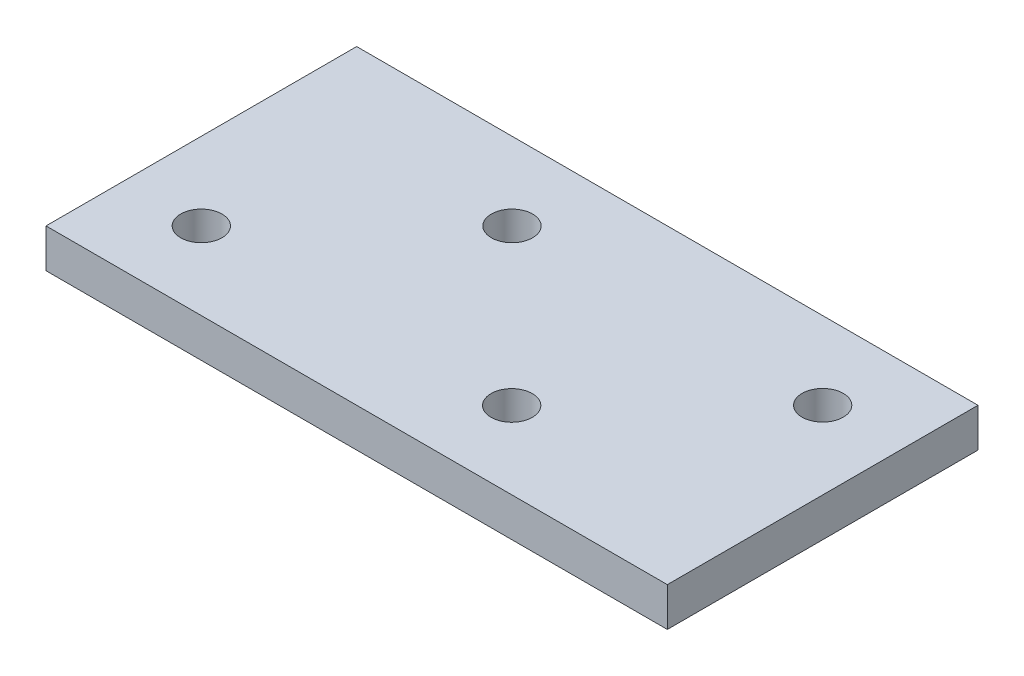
ISO-10303-21;
HEADER;
FILE_DESCRIPTION(('STEP AP214'),'2;1');
FILE_NAME('part.step','',(''),(''),'','','');
FILE_SCHEMA(('AUTOMOTIVE_DESIGN { 1 0 10303 214 1 1 1 1 }'));
ENDSEC;
DATA;
#1=APPLICATION_CONTEXT('core data for automotive mechanical design processes');
#2=APPLICATION_PROTOCOL_DEFINITION('international standard','automotive_design',2000,#1);
#3=PRODUCT_CONTEXT('',#1,'mechanical');
#4=PRODUCT('Part','Part','',(#3));
#5=PRODUCT_RELATED_PRODUCT_CATEGORY('part','',(#4));
#6=PRODUCT_DEFINITION_FORMATION('','',#4);
#7=PRODUCT_DEFINITION_CONTEXT('part definition',#1,'design');
#8=PRODUCT_DEFINITION('design','',#6,#7);
#9=PRODUCT_DEFINITION_SHAPE('','',#8);
#10=(LENGTH_UNIT() NAMED_UNIT(*) SI_UNIT(.MILLI.,.METRE.));
#11=(NAMED_UNIT(*) PLANE_ANGLE_UNIT() SI_UNIT($,.RADIAN.));
#12=(NAMED_UNIT(*) SI_UNIT($,.STERADIAN.) SOLID_ANGLE_UNIT());
#13=UNCERTAINTY_MEASURE_WITH_UNIT(LENGTH_MEASURE(1.E-05),#10,'distance_accuracy_value','');
#14=(GEOMETRIC_REPRESENTATION_CONTEXT(3) GLOBAL_UNCERTAINTY_ASSIGNED_CONTEXT((#13)) GLOBAL_UNIT_ASSIGNED_CONTEXT((#10,
#11,#12)) REPRESENTATION_CONTEXT('',''));
#15=CARTESIAN_POINT('',(0.,0.,0.));
#16=DIRECTION('',(0.,0.,1.));
#17=DIRECTION('',(1.,0.,0.));
#18=AXIS2_PLACEMENT_3D('',#15,#16,#17);
#19=CARTESIAN_POINT('',(0.,6.3500000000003,-50.8000000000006));
#20=DIRECTION('',(0.,-1.,0.));
#21=DIRECTION('',(0.,0.,-1.));
#22=AXIS2_PLACEMENT_3D('',#19,#20,#21);
#23=PLANE('',#22);
#24=CARTESIAN_POINT('',(88.9000000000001,6.34999999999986,-38.0999999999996));
#25=DIRECTION('',(0.,1.,0.));
#26=DIRECTION('',(0.,0.,1.));
#27=AXIS2_PLACEMENT_3D('',#24,#25,#26);
#28=CIRCLE('',#27,3.37312000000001);
#29=CARTESIAN_POINT('',(88.9000000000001,6.34999999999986,-34.7268799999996));
#30=VERTEX_POINT('',#29);
#31=EDGE_CURVE('E118',#30,#30,#28,.T.);
#32=ORIENTED_EDGE('',*,*,#31,.F.);
#33=EDGE_LOOP('',(#32));
#34=FACE_BOUND('',#33,.T.);
#35=CARTESIAN_POINT('',(12.6999999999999,6.3500000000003,-12.700000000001));
#36=DIRECTION('',(0.,1.,0.));
#37=DIRECTION('',(0.,0.,1.));
#38=AXIS2_PLACEMENT_3D('',#35,#36,#37);
#39=CIRCLE('',#38,3.37312);
#40=CARTESIAN_POINT('',(12.6999999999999,6.3500000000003,-9.32688000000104));
#41=VERTEX_POINT('',#40);
#42=EDGE_CURVE('E97',#41,#41,#39,.T.);
#43=ORIENTED_EDGE('',*,*,#42,.F.);
#44=EDGE_LOOP('',(#43));
#45=FACE_BOUND('',#44,.T.);
#46=DIRECTION('',(0.,0.,1.));
#47=VECTOR('',#46,1.);
#48=CARTESIAN_POINT('',(0.,6.3500000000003,0.));
#49=LINE('',#48,#47);
#50=CARTESIAN_POINT('',(0.,6.3500000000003,-50.8000000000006));
#51=VERTEX_POINT('',#50);
#52=CARTESIAN_POINT('',(0.,6.3500000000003,0.));
#53=VERTEX_POINT('',#52);
#54=EDGE_CURVE('E82',#51,#53,#49,.T.);
#55=ORIENTED_EDGE('',*,*,#54,.T.);
#56=DIRECTION('',(1.,0.,0.));
#57=VECTOR('',#56,1.);
#58=CARTESIAN_POINT('',(0.,6.3500000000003,0.));
#59=LINE('',#58,#57);
#60=CARTESIAN_POINT('',(101.6,6.34999999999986,8.88178419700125E-13));
#61=VERTEX_POINT('',#60);
#62=EDGE_CURVE('E77',#53,#61,#59,.T.);
#63=ORIENTED_EDGE('',*,*,#62,.T.);
#64=DIRECTION('',(0.,0.,-1.));
#65=VECTOR('',#64,1.);
#66=CARTESIAN_POINT('',(101.6,6.34999999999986,8.88178419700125E-13));
#67=LINE('',#66,#65);
#68=CARTESIAN_POINT('',(101.6,6.34999999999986,-50.8000000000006));
#69=VERTEX_POINT('',#68);
#70=EDGE_CURVE('E80',#61,#69,#67,.T.);
#71=ORIENTED_EDGE('',*,*,#70,.T.);
#72=DIRECTION('',(-1.,0.,0.));
#73=VECTOR('',#72,1.);
#74=CARTESIAN_POINT('',(0.,6.3500000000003,-50.8000000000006));
#75=LINE('',#74,#73);
#76=EDGE_CURVE('E47',#69,#51,#75,.T.);
#77=ORIENTED_EDGE('',*,*,#76,.T.);
#78=EDGE_LOOP('',(#55,#63,#71,#77));
#79=FACE_BOUND('',#78,.T.);
#80=CARTESIAN_POINT('',(38.1,6.3500000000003,-38.1));
#81=DIRECTION('',(0.,1.,0.));
#82=DIRECTION('',(0.,0.,1.));
#83=AXIS2_PLACEMENT_3D('',#80,#81,#82);
#84=CIRCLE('',#83,3.37312);
#85=CARTESIAN_POINT('',(38.1,6.3500000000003,-34.72688));
#86=VERTEX_POINT('',#85);
#87=EDGE_CURVE('E112',#86,#86,#84,.T.);
#88=ORIENTED_EDGE('',*,*,#87,.F.);
#89=EDGE_LOOP('',(#88));
#90=FACE_BOUND('',#89,.T.);
#91=CARTESIAN_POINT('',(63.5000000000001,6.34999999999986,-12.646563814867));
#92=DIRECTION('',(0.,1.,0.));
#93=DIRECTION('',(0.,0.,1.));
#94=AXIS2_PLACEMENT_3D('',#91,#92,#93);
#95=CIRCLE('',#94,3.37312);
#96=CARTESIAN_POINT('',(63.5000000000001,6.34999999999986,-9.27344381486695));
#97=VERTEX_POINT('',#96);
#98=EDGE_CURVE('E124',#97,#97,#95,.T.);
#99=ORIENTED_EDGE('',*,*,#98,.F.);
#100=EDGE_LOOP('',(#99));
#101=FACE_BOUND('',#100,.T.);
#102=ADVANCED_FACE('F30',(#34,#45,#79,#90,#101),#23,.F.);
#103=CARTESIAN_POINT('',(0.,2.22044604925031E-13,-50.8000000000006));
#104=DIRECTION('',(0.,-1.,0.));
#105=DIRECTION('',(0.,0.,-1.));
#106=AXIS2_PLACEMENT_3D('',#103,#104,#105);
#107=PLANE('',#106);
#108=CARTESIAN_POINT('',(88.9000000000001,-2.22044604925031E-13,-38.0999999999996));
#109=DIRECTION('',(0.,1.,0.));
#110=DIRECTION('',(0.,0.,1.));
#111=AXIS2_PLACEMENT_3D('',#108,#109,#110);
#112=CIRCLE('',#111,3.37312000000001);
#113=CARTESIAN_POINT('',(88.9000000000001,-2.22044604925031E-13,-34.7268799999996));
#114=VERTEX_POINT('',#113);
#115=EDGE_CURVE('E121',#114,#114,#112,.T.);
#116=ORIENTED_EDGE('',*,*,#115,.T.);
#117=EDGE_LOOP('',(#116));
#118=FACE_BOUND('',#117,.T.);
#119=CARTESIAN_POINT('',(12.6999999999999,2.22044604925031E-13,-12.7000000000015));
#120=DIRECTION('',(0.,1.,0.));
#121=DIRECTION('',(0.,0.,1.));
#122=AXIS2_PLACEMENT_3D('',#119,#120,#121);
#123=CIRCLE('',#122,3.37312);
#124=CARTESIAN_POINT('',(12.6999999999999,2.22044604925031E-13,-9.32688000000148));
#125=VERTEX_POINT('',#124);
#126=EDGE_CURVE('E109',#125,#125,#123,.T.);
#127=ORIENTED_EDGE('',*,*,#126,.T.);
#128=EDGE_LOOP('',(#127));
#129=FACE_BOUND('',#128,.T.);
#130=DIRECTION('',(0.,0.,1.));
#131=VECTOR('',#130,1.);
#132=CARTESIAN_POINT('',(0.,2.22044604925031E-13,-4.44089209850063E-13));
#133=LINE('',#132,#131);
#134=CARTESIAN_POINT('',(0.,2.22044604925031E-13,-50.8000000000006));
#135=VERTEX_POINT('',#134);
#136=CARTESIAN_POINT('',(0.,2.22044604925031E-13,-4.44089209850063E-13));
#137=VERTEX_POINT('',#136);
#138=EDGE_CURVE('E94',#135,#137,#133,.T.);
#139=ORIENTED_EDGE('',*,*,#138,.F.);
#140=DIRECTION('',(-1.,0.,0.));
#141=VECTOR('',#140,1.);
#142=CARTESIAN_POINT('',(0.,2.22044604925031E-13,-50.8000000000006));
#143=LINE('',#142,#141);
#144=CARTESIAN_POINT('',(101.6,-2.22044604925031E-13,-50.8000000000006));
#145=VERTEX_POINT('',#144);
#146=EDGE_CURVE('E70',#145,#135,#143,.T.);
#147=ORIENTED_EDGE('',*,*,#146,.F.);
#148=DIRECTION('',(0.,0.,-1.));
#149=VECTOR('',#148,1.);
#150=CARTESIAN_POINT('',(101.6,-2.22044604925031E-13,8.88178419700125E-13));
#151=LINE('',#150,#149);
#152=CARTESIAN_POINT('',(101.6,-2.22044604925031E-13,8.88178419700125E-13));
#153=VERTEX_POINT('',#152);
#154=EDGE_CURVE('E64',#153,#145,#151,.T.);
#155=ORIENTED_EDGE('',*,*,#154,.F.);
#156=DIRECTION('',(1.,0.,0.));
#157=VECTOR('',#156,1.);
#158=CARTESIAN_POINT('',(0.,2.22044604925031E-13,-4.44089209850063E-13));
#159=LINE('',#158,#157);
#160=EDGE_CURVE('E86',#137,#153,#159,.T.);
#161=ORIENTED_EDGE('',*,*,#160,.F.);
#162=EDGE_LOOP('',(#139,#147,#155,#161));
#163=FACE_BOUND('',#162,.T.);
#164=CARTESIAN_POINT('',(38.1,2.22044604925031E-13,-38.1000000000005));
#165=DIRECTION('',(0.,1.,0.));
#166=DIRECTION('',(0.,0.,1.));
#167=AXIS2_PLACEMENT_3D('',#164,#165,#166);
#168=CIRCLE('',#167,3.37312);
#169=CARTESIAN_POINT('',(38.1,2.22044604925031E-13,-34.7268800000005));
#170=VERTEX_POINT('',#169);
#171=EDGE_CURVE('E115',#170,#170,#168,.T.);
#172=ORIENTED_EDGE('',*,*,#171,.T.);
#173=EDGE_LOOP('',(#172));
#174=FACE_BOUND('',#173,.T.);
#175=CARTESIAN_POINT('',(63.5000000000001,-2.22044604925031E-13,-12.646563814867));
#176=DIRECTION('',(0.,1.,0.));
#177=DIRECTION('',(0.,0.,1.));
#178=AXIS2_PLACEMENT_3D('',#175,#176,#177);
#179=CIRCLE('',#178,3.37312);
#180=CARTESIAN_POINT('',(63.5000000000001,-2.22044604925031E-13,-9.27344381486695));
#181=VERTEX_POINT('',#180);
#182=EDGE_CURVE('E127',#181,#181,#179,.T.);
#183=ORIENTED_EDGE('',*,*,#182,.T.);
#184=EDGE_LOOP('',(#183));
#185=FACE_BOUND('',#184,.T.);
#186=ADVANCED_FACE('F105',(#118,#129,#163,#174,#185),#107,.T.);
#187=CARTESIAN_POINT('',(0.,6.3500000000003,0.));
#188=DIRECTION('',(1.,0.,0.));
#189=DIRECTION('',(0.,0.,-1.));
#190=AXIS2_PLACEMENT_3D('',#187,#188,#189);
#191=PLANE('',#190);
#192=ORIENTED_EDGE('',*,*,#138,.T.);
#193=DIRECTION('',(0.,-1.,0.));
#194=VECTOR('',#193,1.);
#195=CARTESIAN_POINT('',(0.,6.3500000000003,0.));
#196=LINE('',#195,#194);
#197=EDGE_CURVE('E11',#53,#137,#196,.T.);
#198=ORIENTED_EDGE('',*,*,#197,.F.);
#199=ORIENTED_EDGE('',*,*,#54,.F.);
#200=DIRECTION('',(0.,-1.,0.));
#201=VECTOR('',#200,1.);
#202=CARTESIAN_POINT('',(0.,6.3500000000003,-50.8000000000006));
#203=LINE('',#202,#201);
#204=EDGE_CURVE('E90',#51,#135,#203,.T.);
#205=ORIENTED_EDGE('',*,*,#204,.T.);
#206=EDGE_LOOP('',(#192,#198,#199,#205));
#207=FACE_BOUND('',#206,.T.);
#208=ADVANCED_FACE('F32',(#207),#191,.F.);
#209=CARTESIAN_POINT('',(0.,6.3500000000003,0.));
#210=DIRECTION('',(0.,0.,-1.));
#211=DIRECTION('',(-1.,0.,0.));
#212=AXIS2_PLACEMENT_3D('',#209,#210,#211);
#213=PLANE('',#212);
#214=ORIENTED_EDGE('',*,*,#160,.T.);
#215=DIRECTION('',(0.,-1.,0.));
#216=VECTOR('',#215,1.);
#217=CARTESIAN_POINT('',(101.6,6.34999999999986,8.88178419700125E-13));
#218=LINE('',#217,#216);
#219=EDGE_CURVE('E39',#61,#153,#218,.T.);
#220=ORIENTED_EDGE('',*,*,#219,.F.);
#221=ORIENTED_EDGE('',*,*,#62,.F.);
#222=ORIENTED_EDGE('',*,*,#197,.T.);
#223=EDGE_LOOP('',(#214,#220,#221,#222));
#224=FACE_BOUND('',#223,.T.);
#225=ADVANCED_FACE('F85',(#224),#213,.F.);
#226=CARTESIAN_POINT('',(101.6,6.34999999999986,8.88178419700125E-13));
#227=DIRECTION('',(-1.,0.,0.));
#228=DIRECTION('',(0.,0.,1.));
#229=AXIS2_PLACEMENT_3D('',#226,#227,#228);
#230=PLANE('',#229);
#231=ORIENTED_EDGE('',*,*,#154,.T.);
#232=DIRECTION('',(0.,-1.,0.));
#233=VECTOR('',#232,1.);
#234=CARTESIAN_POINT('',(101.6,6.34999999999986,-50.8000000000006));
#235=LINE('',#234,#233);
#236=EDGE_CURVE('E87',#69,#145,#235,.T.);
#237=ORIENTED_EDGE('',*,*,#236,.F.);
#238=ORIENTED_EDGE('',*,*,#70,.F.);
#239=ORIENTED_EDGE('',*,*,#219,.T.);
#240=EDGE_LOOP('',(#231,#237,#238,#239));
#241=FACE_BOUND('',#240,.T.);
#242=ADVANCED_FACE('F88',(#241),#230,.F.);
#243=CARTESIAN_POINT('',(0.,6.3500000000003,-50.8000000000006));
#244=DIRECTION('',(0.,0.,1.));
#245=DIRECTION('',(1.,0.,0.));
#246=AXIS2_PLACEMENT_3D('',#243,#244,#245);
#247=PLANE('',#246);
#248=ORIENTED_EDGE('',*,*,#146,.T.);
#249=ORIENTED_EDGE('',*,*,#204,.F.);
#250=ORIENTED_EDGE('',*,*,#76,.F.);
#251=ORIENTED_EDGE('',*,*,#236,.T.);
#252=EDGE_LOOP('',(#248,#249,#250,#251));
#253=FACE_BOUND('',#252,.T.);
#254=ADVANCED_FACE('F102',(#253),#247,.F.);
#255=CARTESIAN_POINT('',(12.6999999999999,6.3500000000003,-12.700000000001));
#256=DIRECTION('',(0.,-1.,0.));
#257=DIRECTION('',(0.,0.,-1.));
#258=AXIS2_PLACEMENT_3D('',#255,#256,#257);
#259=CYLINDRICAL_SURFACE('',#258,3.37312);
#260=ORIENTED_EDGE('',*,*,#42,.T.);
#261=EDGE_LOOP('',(#260));
#262=FACE_BOUND('',#261,.T.);
#263=ORIENTED_EDGE('',*,*,#126,.F.);
#264=EDGE_LOOP('',(#263));
#265=FACE_BOUND('',#264,.T.);
#266=ADVANCED_FACE('F147',(#262,#265),#259,.F.);
#267=CARTESIAN_POINT('',(38.1,6.3500000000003,-38.1));
#268=DIRECTION('',(0.,-1.,0.));
#269=DIRECTION('',(0.,0.,-1.));
#270=AXIS2_PLACEMENT_3D('',#267,#268,#269);
#271=CYLINDRICAL_SURFACE('',#270,3.37312);
#272=ORIENTED_EDGE('',*,*,#87,.T.);
#273=EDGE_LOOP('',(#272));
#274=FACE_BOUND('',#273,.T.);
#275=ORIENTED_EDGE('',*,*,#171,.F.);
#276=EDGE_LOOP('',(#275));
#277=FACE_BOUND('',#276,.T.);
#278=ADVANCED_FACE('F182',(#274,#277),#271,.F.);
#279=CARTESIAN_POINT('',(88.9000000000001,6.34999999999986,-38.0999999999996));
#280=DIRECTION('',(0.,-1.,0.));
#281=DIRECTION('',(0.,0.,-1.));
#282=AXIS2_PLACEMENT_3D('',#279,#280,#281);
#283=CYLINDRICAL_SURFACE('',#282,3.37312000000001);
#284=ORIENTED_EDGE('',*,*,#31,.T.);
#285=EDGE_LOOP('',(#284));
#286=FACE_BOUND('',#285,.T.);
#287=ORIENTED_EDGE('',*,*,#115,.F.);
#288=EDGE_LOOP('',(#287));
#289=FACE_BOUND('',#288,.T.);
#290=ADVANCED_FACE('F189',(#286,#289),#283,.F.);
#291=CARTESIAN_POINT('',(63.5000000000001,6.34999999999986,-12.646563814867));
#292=DIRECTION('',(0.,-1.,0.));
#293=DIRECTION('',(0.,0.,-1.));
#294=AXIS2_PLACEMENT_3D('',#291,#292,#293);
#295=CYLINDRICAL_SURFACE('',#294,3.37312);
#296=ORIENTED_EDGE('',*,*,#98,.T.);
#297=EDGE_LOOP('',(#296));
#298=FACE_BOUND('',#297,.T.);
#299=ORIENTED_EDGE('',*,*,#182,.F.);
#300=EDGE_LOOP('',(#299));
#301=FACE_BOUND('',#300,.T.);
#302=ADVANCED_FACE('F133',(#298,#301),#295,.F.);
#303=CLOSED_SHELL('',(#102,#186,#208,#225,#242,#254,#266,#278,#290,#302));
#304=MANIFOLD_SOLID_BREP('B2',#303);
#305=ADVANCED_BREP_SHAPE_REPRESENTATION('',(#18,#304),#14);
#306=SHAPE_DEFINITION_REPRESENTATION(#9,#305);
ENDSEC;
END-ISO-10303-21;
